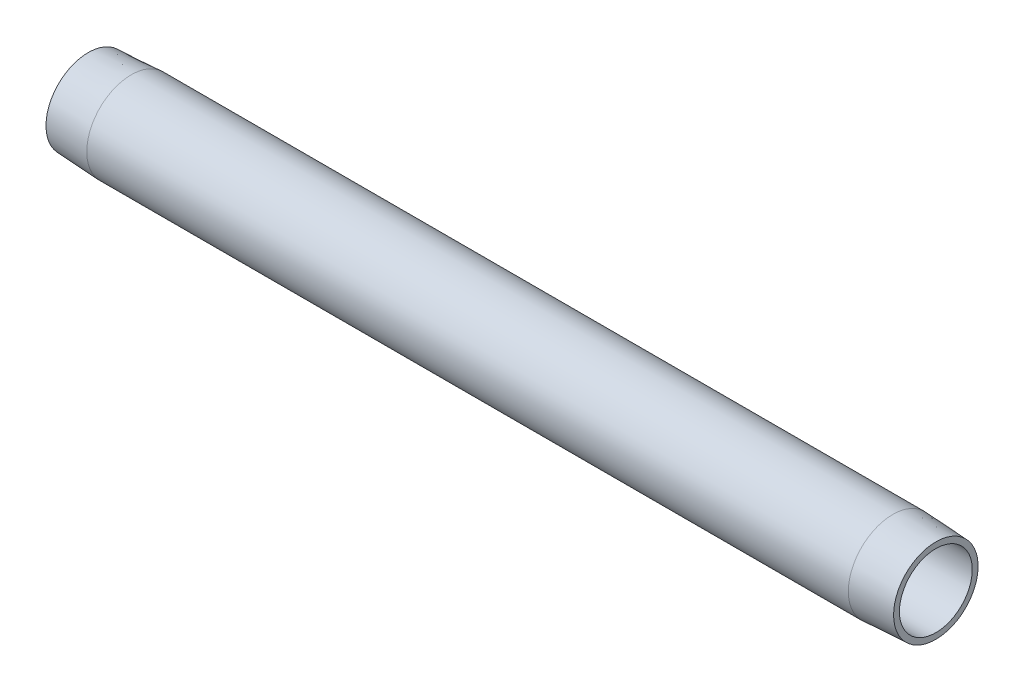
ISO-10303-21;
HEADER;
FILE_DESCRIPTION(('STEP AP214'),'2;1');
FILE_NAME('part.step','',(''),(''),'','','');
FILE_SCHEMA(('AUTOMOTIVE_DESIGN { 1 0 10303 214 1 1 1 1 }'));
ENDSEC;
DATA;
#1=APPLICATION_CONTEXT('core data for automotive mechanical design processes');
#2=APPLICATION_PROTOCOL_DEFINITION('international standard','automotive_design',2000,#1);
#3=PRODUCT_CONTEXT('',#1,'mechanical');
#4=PRODUCT('Part','Part','',(#3));
#5=PRODUCT_RELATED_PRODUCT_CATEGORY('part','',(#4));
#6=PRODUCT_DEFINITION_FORMATION('','',#4);
#7=PRODUCT_DEFINITION_CONTEXT('part definition',#1,'design');
#8=PRODUCT_DEFINITION('design','',#6,#7);
#9=PRODUCT_DEFINITION_SHAPE('','',#8);
#10=(LENGTH_UNIT() NAMED_UNIT(*) SI_UNIT(.MILLI.,.METRE.));
#11=(NAMED_UNIT(*) PLANE_ANGLE_UNIT() SI_UNIT($,.RADIAN.));
#12=(NAMED_UNIT(*) SI_UNIT($,.STERADIAN.) SOLID_ANGLE_UNIT());
#13=UNCERTAINTY_MEASURE_WITH_UNIT(LENGTH_MEASURE(1.E-05),#10,'distance_accuracy_value','');
#14=(GEOMETRIC_REPRESENTATION_CONTEXT(3) GLOBAL_UNCERTAINTY_ASSIGNED_CONTEXT((#13)) GLOBAL_UNIT_ASSIGNED_CONTEXT((#10,
#11,#12)) REPRESENTATION_CONTEXT('',''));
#15=CARTESIAN_POINT('',(0.,0.,0.));
#16=DIRECTION('',(0.,0.,1.));
#17=DIRECTION('',(1.,0.,0.));
#18=AXIS2_PLACEMENT_3D('',#15,#16,#17);
#19=CARTESIAN_POINT('',(203.2,8.73125,0.));
#20=DIRECTION('',(-1.,0.,0.));
#21=DIRECTION('',(0.,0.,1.));
#22=AXIS2_PLACEMENT_3D('',#19,#20,#21);
#23=PLANE('',#22);
#24=CARTESIAN_POINT('',(203.2,0.,0.));
#25=DIRECTION('',(-1.,0.,0.));
#26=DIRECTION('',(0.,0.,1.));
#27=AXIS2_PLACEMENT_3D('',#24,#25,#26);
#28=CIRCLE('',#27,10.1275500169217);
#29=CARTESIAN_POINT('',(203.2,0.,10.1275500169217));
#30=VERTEX_POINT('',#29);
#31=EDGE_CURVE('E10',#30,#30,#28,.T.);
#32=ORIENTED_EDGE('',*,*,#31,.F.);
#33=EDGE_LOOP('',(#32));
#34=FACE_BOUND('',#33,.T.);
#35=CARTESIAN_POINT('',(203.2,0.,0.));
#36=DIRECTION('',(-1.,0.,0.));
#37=DIRECTION('',(0.,0.,1.));
#38=AXIS2_PLACEMENT_3D('',#35,#36,#37);
#39=CIRCLE('',#38,8.73125);
#40=CARTESIAN_POINT('',(203.2,0.,8.73125));
#41=VERTEX_POINT('',#40);
#42=EDGE_CURVE('E52',#41,#41,#39,.T.);
#43=ORIENTED_EDGE('',*,*,#42,.T.);
#44=EDGE_LOOP('',(#43));
#45=FACE_BOUND('',#44,.T.);
#46=ADVANCED_FACE('F30',(#34,#45),#23,.F.);
#47=CARTESIAN_POINT('',(203.2,0.,0.));
#48=DIRECTION('',(-1.,0.,0.));
#49=DIRECTION('',(0.,0.,1.));
#50=AXIS2_PLACEMENT_3D('',#47,#48,#49);
#51=CONICAL_SURFACE('',#50,10.1275500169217,0.0523598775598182);
#52=CARTESIAN_POINT('',(192.8876,0.,0.));
#53=DIRECTION('',(-1.,0.,0.));
#54=DIRECTION('',(0.,0.,1.));
#55=AXIS2_PLACEMENT_3D('',#52,#53,#54);
#56=CIRCLE('',#55,10.668);
#57=CARTESIAN_POINT('',(192.8876,0.,10.668));
#58=VERTEX_POINT('',#57);
#59=EDGE_CURVE('E36',#58,#58,#56,.T.);
#60=ORIENTED_EDGE('',*,*,#59,.F.);
#61=EDGE_LOOP('',(#60));
#62=FACE_BOUND('',#61,.T.);
#63=ORIENTED_EDGE('',*,*,#31,.T.);
#64=EDGE_LOOP('',(#63));
#65=FACE_BOUND('',#64,.T.);
#66=ADVANCED_FACE('F77',(#62,#65),#51,.T.);
#67=CARTESIAN_POINT('',(0.,0.,0.));
#68=DIRECTION('',(-1.,0.,0.));
#69=DIRECTION('',(0.,0.,1.));
#70=AXIS2_PLACEMENT_3D('',#67,#68,#69);
#71=CYLINDRICAL_SURFACE('',#70,10.668);
#72=CARTESIAN_POINT('',(10.3124,0.,0.));
#73=DIRECTION('',(-1.,0.,0.));
#74=DIRECTION('',(0.,0.,1.));
#75=AXIS2_PLACEMENT_3D('',#72,#73,#74);
#76=CIRCLE('',#75,10.668);
#77=CARTESIAN_POINT('',(10.3124,0.,10.668));
#78=VERTEX_POINT('',#77);
#79=EDGE_CURVE('E40',#78,#78,#76,.T.);
#80=ORIENTED_EDGE('',*,*,#79,.F.);
#81=EDGE_LOOP('',(#80));
#82=FACE_BOUND('',#81,.T.);
#83=ORIENTED_EDGE('',*,*,#59,.T.);
#84=EDGE_LOOP('',(#83));
#85=FACE_BOUND('',#84,.T.);
#86=ADVANCED_FACE('F72',(#82,#85),#71,.T.);
#87=CARTESIAN_POINT('',(10.3124,0.,0.));
#88=DIRECTION('',(1.,0.,0.));
#89=DIRECTION('',(0.,0.,-1.));
#90=AXIS2_PLACEMENT_3D('',#87,#88,#89);
#91=CONICAL_SURFACE('',#90,10.668,0.0523598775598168);
#92=CARTESIAN_POINT('',(0.,0.,0.));
#93=DIRECTION('',(-1.,0.,0.));
#94=DIRECTION('',(0.,0.,1.));
#95=AXIS2_PLACEMENT_3D('',#92,#93,#94);
#96=CIRCLE('',#95,10.1275500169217);
#97=CARTESIAN_POINT('',(0.,0.,10.1275500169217));
#98=VERTEX_POINT('',#97);
#99=EDGE_CURVE('E44',#98,#98,#96,.T.);
#100=ORIENTED_EDGE('',*,*,#99,.F.);
#101=EDGE_LOOP('',(#100));
#102=FACE_BOUND('',#101,.T.);
#103=ORIENTED_EDGE('',*,*,#79,.T.);
#104=EDGE_LOOP('',(#103));
#105=FACE_BOUND('',#104,.T.);
#106=ADVANCED_FACE('F66',(#102,#105),#91,.T.);
#107=CARTESIAN_POINT('',(0.,10.1275500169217,0.));
#108=DIRECTION('',(1.,0.,0.));
#109=DIRECTION('',(0.,0.,-1.));
#110=AXIS2_PLACEMENT_3D('',#107,#108,#109);
#111=PLANE('',#110);
#112=CARTESIAN_POINT('',(0.,0.,0.));
#113=DIRECTION('',(-1.,0.,0.));
#114=DIRECTION('',(0.,0.,1.));
#115=AXIS2_PLACEMENT_3D('',#112,#113,#114);
#116=CIRCLE('',#115,8.73125);
#117=CARTESIAN_POINT('',(0.,0.,8.73125));
#118=VERTEX_POINT('',#117);
#119=EDGE_CURVE('E49',#118,#118,#116,.T.);
#120=ORIENTED_EDGE('',*,*,#119,.F.);
#121=EDGE_LOOP('',(#120));
#122=FACE_BOUND('',#121,.T.);
#123=ORIENTED_EDGE('',*,*,#99,.T.);
#124=EDGE_LOOP('',(#123));
#125=FACE_BOUND('',#124,.T.);
#126=ADVANCED_FACE('F60',(#122,#125),#111,.F.);
#127=CARTESIAN_POINT('',(0.,0.,0.));
#128=DIRECTION('',(-1.,0.,0.));
#129=DIRECTION('',(0.,0.,1.));
#130=AXIS2_PLACEMENT_3D('',#127,#128,#129);
#131=CYLINDRICAL_SURFACE('',#130,8.73125);
#132=ORIENTED_EDGE('',*,*,#42,.F.);
#133=EDGE_LOOP('',(#132));
#134=FACE_BOUND('',#133,.T.);
#135=ORIENTED_EDGE('',*,*,#119,.T.);
#136=EDGE_LOOP('',(#135));
#137=FACE_BOUND('',#136,.T.);
#138=ADVANCED_FACE('F57',(#134,#137),#131,.F.);
#139=CLOSED_SHELL('',(#46,#66,#86,#106,#126,#138));
#140=MANIFOLD_SOLID_BREP('B2',#139);
#141=ADVANCED_BREP_SHAPE_REPRESENTATION('',(#18,#140),#14);
#142=SHAPE_DEFINITION_REPRESENTATION(#9,#141);
ENDSEC;
END-ISO-10303-21;
